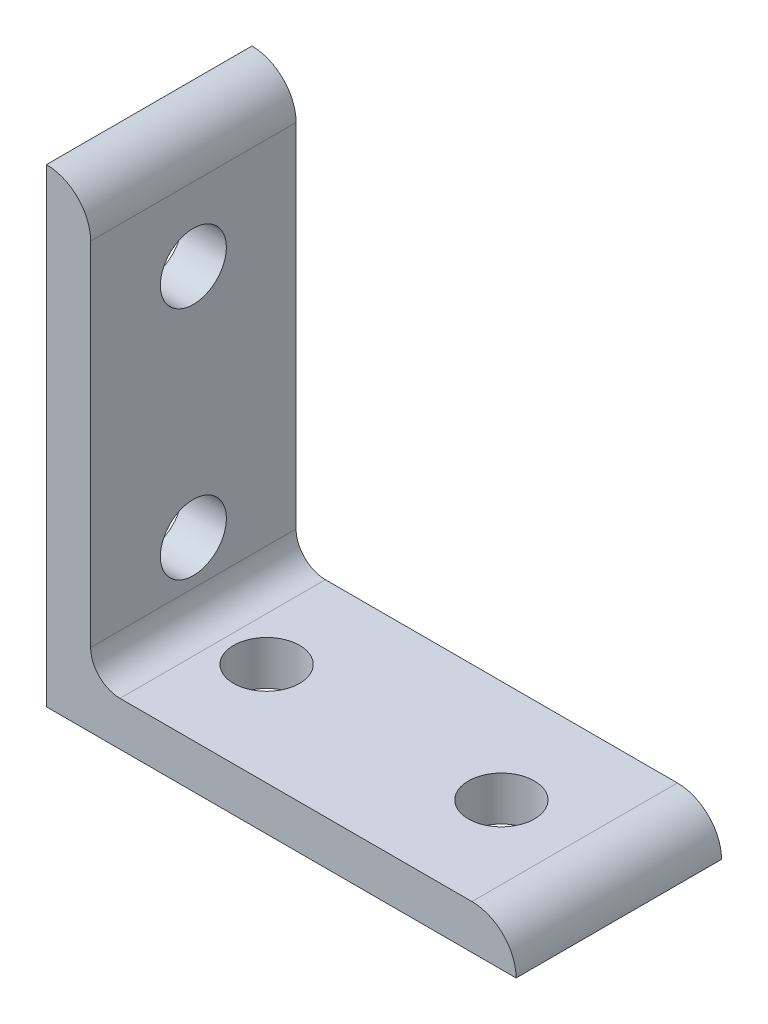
from build123d import *

# Parameters (mm, degrees)
BOSS_EXTRUDE1_DEPTH = 11.1125
SKETCH2_R           = 3.5687
CUT_EXTRUDE1_DEPTH  = 73.696407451
SKETCH3_R           = 3.5687
CUT_EXTRUDE2_DEPTH  = 73.696407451


with BuildPart() as part:
    # Sketch1 → Boss-Extrude1 (new, symmetric)
    with BuildSketch(Plane.XY):
        with BuildLine():
            Line((0, 0), (0, 50.8))
            ThreePointArc((0, 50.8), (3.376576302, 49.401376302), (4.7752, 46.0248))
            Line((4.7752, 46.0248), (4.7752, 7.9502))
            ThreePointArc((4.7752, 7.9502), (5.70513597, 5.70513597), (7.9502, 4.7752))
            Line((7.9502, 4.7752), (46.0248, 4.7752))
            ThreePointArc((46.0248, 4.7752), (49.401376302, 3.376576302), (50.8, 0))
            Line((50.8, 0), (0, 0))
        make_face()
    extrude(amount=BOSS_EXTRUDE1_DEPTH, both=True)

    # Sketch2 → Cut-Extrude1 (cut, through all)
    with BuildSketch(Plane(origin=(0, 0, 0), x_dir=(1, 0, 0), z_dir=(0, 1, 0))):
        with Locations(Location((12.7, 0, 0), (0, 0, 90))):
            Circle(SKETCH2_R)
        with Locations(Location((38.1, 0, 0), (0, 0, 90))):
            Circle(SKETCH2_R)
    extrude(amount=CUT_EXTRUDE1_DEPTH, mode=Mode.SUBTRACT)

    # Sketch3 → Cut-Extrude2 (cut, through all)
    with BuildSketch(Plane(origin=(0, 0, 0), x_dir=(0, 0, -1), z_dir=(1, 0, 0))):
        with Locations(Location((0, 12.7, 0), (0, 0, 180))):
            Circle(SKETCH3_R)
        with Locations(Location((0, 38.1, 0), (0, 0, 180))):
            Circle(SKETCH3_R)
    extrude(amount=CUT_EXTRUDE2_DEPTH, mode=Mode.SUBTRACT)


solid = part.part
